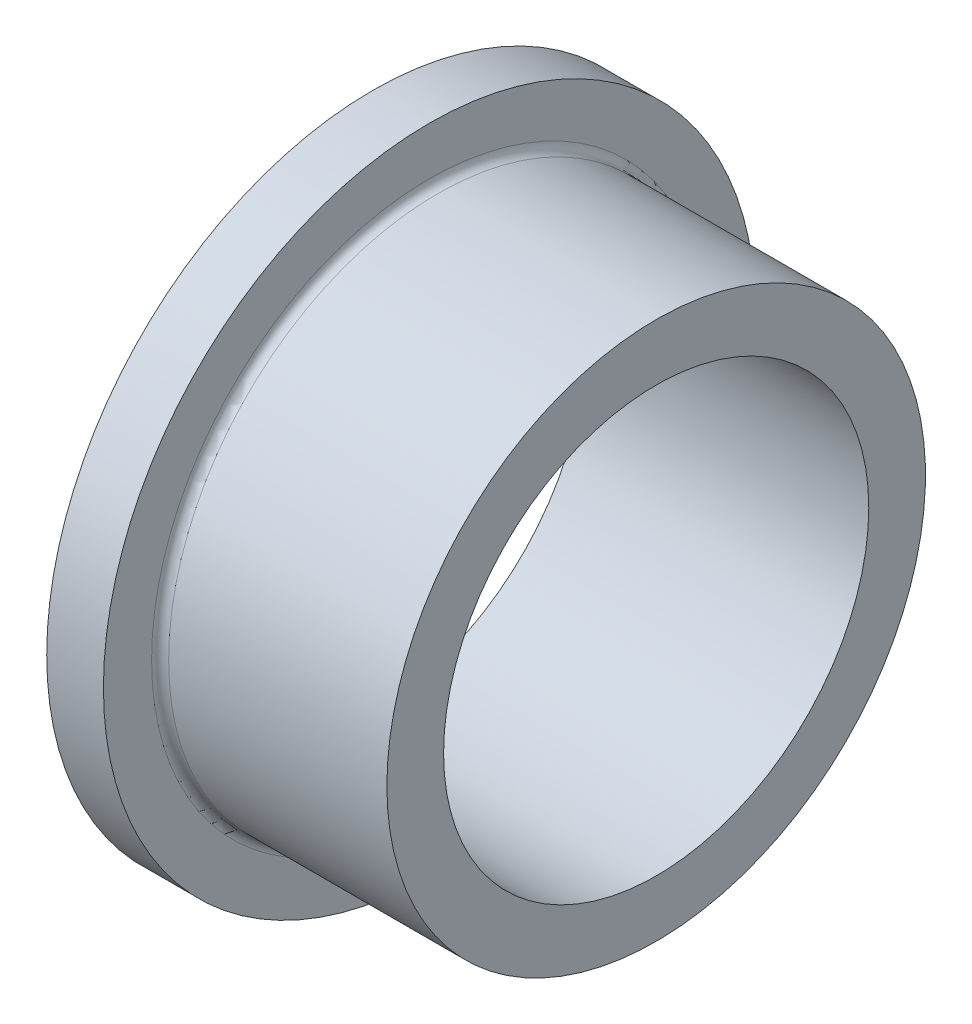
from build123d import *


with BuildPart() as part:
    # Esquisse1 → Coussinet (revolve)
    with BuildSketch(Plane.XY, mode=Mode.PRIVATE) as coussinet_sk:
        with BuildLine():
            Line((0, 23), (0, 15))
            Line((0, 15), (20, 15))
            Line((20, 15), (20, 19))
            Line((20, 19), (4.6, 19))
            ThreePointArc((4.6, 19), (4.175735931, 19.175735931), (4, 19.6))
            Line((4, 19.6), (4, 23))
            Line((4, 23), (0, 23))
        make_face()
    revolve(coussinet_sk.sketch.rotate(Axis((0, 0, 0), (1, 0, 0)), 90), axis=Axis((0, 0, 0), (1, 0, 0)))


solid = part.part
